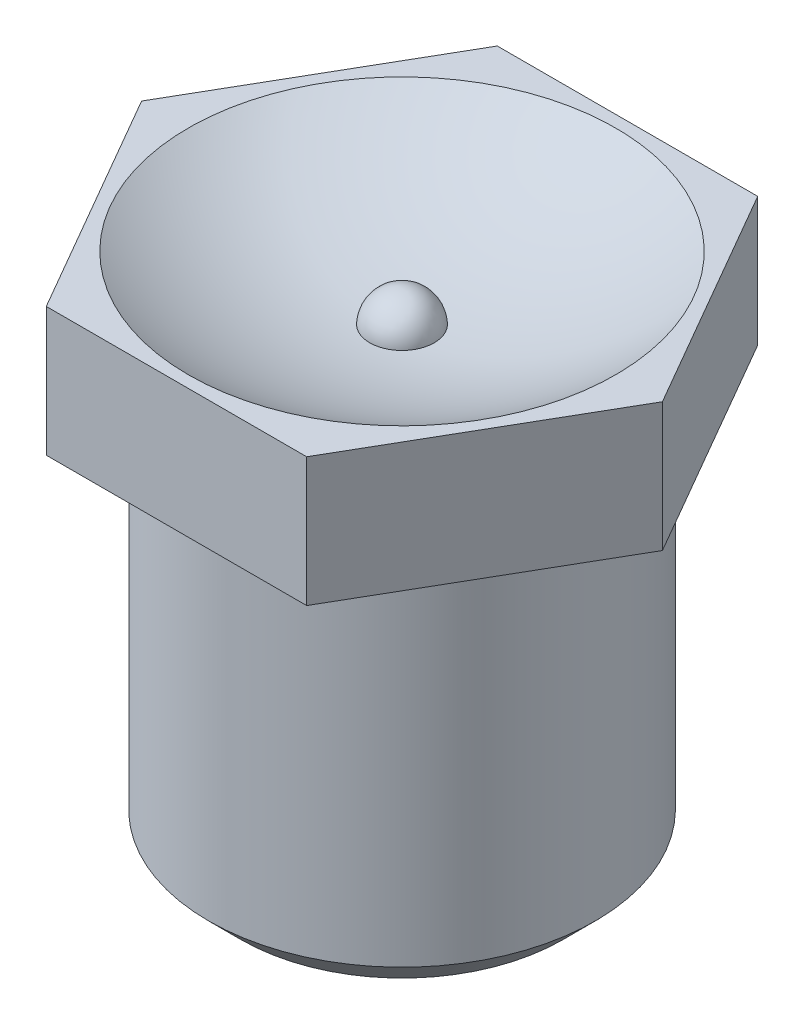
ISO-10303-21;
HEADER;
FILE_DESCRIPTION(('STEP AP214'),'2;1');
FILE_NAME('part.step','',(''),(''),'','','');
FILE_SCHEMA(('AUTOMOTIVE_DESIGN { 1 0 10303 214 1 1 1 1 }'));
ENDSEC;
DATA;
#1=APPLICATION_CONTEXT('core data for automotive mechanical design processes');
#2=APPLICATION_PROTOCOL_DEFINITION('international standard','automotive_design',2000,#1);
#3=PRODUCT_CONTEXT('',#1,'mechanical');
#4=PRODUCT('Part','Part','',(#3));
#5=PRODUCT_RELATED_PRODUCT_CATEGORY('part','',(#4));
#6=PRODUCT_DEFINITION_FORMATION('','',#4);
#7=PRODUCT_DEFINITION_CONTEXT('part definition',#1,'design');
#8=PRODUCT_DEFINITION('design','',#6,#7);
#9=PRODUCT_DEFINITION_SHAPE('','',#8);
#10=(LENGTH_UNIT() NAMED_UNIT(*) SI_UNIT(.MILLI.,.METRE.));
#11=(NAMED_UNIT(*) PLANE_ANGLE_UNIT() SI_UNIT($,.RADIAN.));
#12=(NAMED_UNIT(*) SI_UNIT($,.STERADIAN.) SOLID_ANGLE_UNIT());
#13=UNCERTAINTY_MEASURE_WITH_UNIT(LENGTH_MEASURE(1.E-05),#10,'distance_accuracy_value','');
#14=(GEOMETRIC_REPRESENTATION_CONTEXT(3) GLOBAL_UNCERTAINTY_ASSIGNED_CONTEXT((#13)) GLOBAL_UNIT_ASSIGNED_CONTEXT((#10,
#11,#12)) REPRESENTATION_CONTEXT('',''));
#15=CARTESIAN_POINT('',(0.,0.,0.));
#16=DIRECTION('',(0.,0.,1.));
#17=DIRECTION('',(1.,0.,0.));
#18=AXIS2_PLACEMENT_3D('',#15,#16,#17);
#19=CARTESIAN_POINT('',(0.,7.,-3.05311331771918E-13));
#20=DIRECTION('',(-1.,0.,0.));
#21=DIRECTION('',(0.,-1.,0.));
#22=AXIS2_PLACEMENT_3D('',#19,#20,#21);
#23=SPHERICAL_SURFACE('',#22,6.);
#24=CARTESIAN_POINT('',(0.,7.,-3.05311331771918E-13));
#25=DIRECTION('',(0.,1.,0.));
#26=DIRECTION('',(0.,0.,1.));
#27=AXIS2_PLACEMENT_3D('',#24,#25,#26);
#28=SPHERICAL_SURFACE('',#27,6.);
#29=CARTESIAN_POINT('',(0.,2.,-3.05311331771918E-13));
#30=DIRECTION('',(0.,1.,0.));
#31=DIRECTION('',(0.,0.,1.));
#32=AXIS2_PLACEMENT_3D('',#29,#30,#31);
#33=CIRCLE('',#32,3.3166247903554);
#34=CARTESIAN_POINT('',(0.,2.,3.31662479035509));
#35=VERTEX_POINT('',#34);
#36=EDGE_CURVE('E126',#35,#35,#33,.T.);
#37=ORIENTED_EDGE('',*,*,#36,.T.);
#38=EDGE_LOOP('',(#37));
#39=FACE_BOUND('',#38,.T.);
#40=CARTESIAN_POINT('',(0.,1.02083333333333,-3.05311331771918E-13));
#41=DIRECTION('',(0.,-1.,0.));
#42=DIRECTION('',(0.,0.,-1.));
#43=AXIS2_PLACEMENT_3D('',#40,#41,#42);
#44=CIRCLE('',#43,0.49956578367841);
#45=CARTESIAN_POINT('',(0.,1.02083333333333,-0.499565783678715));
#46=VERTEX_POINT('',#45);
#47=EDGE_CURVE('E11',#46,#46,#44,.F.);
#48=ORIENTED_EDGE('',*,*,#47,.F.);
#49=EDGE_LOOP('',(#48));
#50=FACE_BOUND('',#49,.T.);
#51=ADVANCED_FACE('F36',(#39,#50),#28,.F.);
#52=CARTESIAN_POINT('',(0.,-6.,0.));
#53=DIRECTION('',(0.,1.,0.));
#54=DIRECTION('',(0.,0.,1.));
#55=AXIS2_PLACEMENT_3D('',#52,#53,#54);
#56=CYLINDRICAL_SURFACE('',#55,3.);
#57=CARTESIAN_POINT('',(0.,-5.5,0.));
#58=DIRECTION('',(0.,1.,0.));
#59=DIRECTION('',(0.,0.,1.));
#60=AXIS2_PLACEMENT_3D('',#57,#58,#59);
#61=CIRCLE('',#60,3.);
#62=CARTESIAN_POINT('',(0.,-5.5,3.));
#63=VERTEX_POINT('',#62);
#64=EDGE_CURVE('E145',#63,#63,#61,.T.);
#65=ORIENTED_EDGE('',*,*,#64,.T.);
#66=EDGE_LOOP('',(#65));
#67=FACE_BOUND('',#66,.T.);
#68=CARTESIAN_POINT('',(0.,0.,0.));
#69=DIRECTION('',(0.,1.,0.));
#70=DIRECTION('',(0.,0.,1.));
#71=AXIS2_PLACEMENT_3D('',#68,#69,#70);
#72=CIRCLE('',#71,3.);
#73=CARTESIAN_POINT('',(0.,0.,3.));
#74=VERTEX_POINT('',#73);
#75=EDGE_CURVE('E142',#74,#74,#72,.T.);
#76=ORIENTED_EDGE('',*,*,#75,.F.);
#77=EDGE_LOOP('',(#76));
#78=FACE_BOUND('',#77,.T.);
#79=ADVANCED_FACE('F167',(#67,#78),#56,.T.);
#80=CARTESIAN_POINT('',(0.,-6.,0.));
#81=DIRECTION('',(0.,1.,0.));
#82=DIRECTION('',(0.,0.,1.));
#83=AXIS2_PLACEMENT_3D('',#80,#81,#82);
#84=PLANE('',#83);
#85=CARTESIAN_POINT('',(0.,-6.,0.));
#86=DIRECTION('',(0.,1.,0.));
#87=DIRECTION('',(0.,0.,1.));
#88=AXIS2_PLACEMENT_3D('',#85,#86,#87);
#89=CIRCLE('',#88,2.5);
#90=CARTESIAN_POINT('',(0.,-6.,2.5));
#91=VERTEX_POINT('',#90);
#92=EDGE_CURVE('E45',#91,#91,#89,.F.);
#93=ORIENTED_EDGE('',*,*,#92,.T.);
#94=EDGE_LOOP('',(#93));
#95=FACE_BOUND('',#94,.T.);
#96=ADVANCED_FACE('F171',(#95),#84,.F.);
#97=CARTESIAN_POINT('',(-2.02072594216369,1.99999999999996,3.4999999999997));
#98=DIRECTION('',(0.,0.,-1.));
#99=DIRECTION('',(-1.,0.,0.));
#100=AXIS2_PLACEMENT_3D('',#97,#98,#99);
#101=PLANE('',#100);
#102=DIRECTION('',(1.,0.,0.));
#103=VECTOR('',#102,1.);
#104=CARTESIAN_POINT('',(-2.02072594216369,0.,3.5));
#105=LINE('',#104,#103);
#106=CARTESIAN_POINT('',(-2.02072594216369,0.,3.5));
#107=VERTEX_POINT('',#106);
#108=CARTESIAN_POINT('',(2.02072594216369,0.,3.5));
#109=VERTEX_POINT('',#108);
#110=EDGE_CURVE('E122',#107,#109,#105,.T.);
#111=ORIENTED_EDGE('',*,*,#110,.T.);
#112=DIRECTION('',(0.,-1.,0.));
#113=VECTOR('',#112,1.);
#114=CARTESIAN_POINT('',(2.02072594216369,2.,3.4999999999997));
#115=LINE('',#114,#113);
#116=CARTESIAN_POINT('',(2.02072594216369,2.,3.4999999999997));
#117=VERTEX_POINT('',#116);
#118=EDGE_CURVE('E140',#117,#109,#115,.T.);
#119=ORIENTED_EDGE('',*,*,#118,.F.);
#120=DIRECTION('',(1.,0.,0.));
#121=VECTOR('',#120,1.);
#122=CARTESIAN_POINT('',(-2.02072594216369,1.99999999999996,3.4999999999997));
#123=LINE('',#122,#121);
#124=CARTESIAN_POINT('',(-2.02072594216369,1.99999999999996,3.4999999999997));
#125=VERTEX_POINT('',#124);
#126=EDGE_CURVE('E133',#125,#117,#123,.T.);
#127=ORIENTED_EDGE('',*,*,#126,.F.);
#128=DIRECTION('',(0.,-1.,0.));
#129=VECTOR('',#128,1.);
#130=CARTESIAN_POINT('',(-2.02072594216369,1.99999999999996,3.4999999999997));
#131=LINE('',#130,#129);
#132=EDGE_CURVE('E118',#125,#107,#131,.T.);
#133=ORIENTED_EDGE('',*,*,#132,.T.);
#134=EDGE_LOOP('',(#111,#119,#127,#133));
#135=FACE_BOUND('',#134,.T.);
#136=ADVANCED_FACE('F194',(#135),#101,.F.);
#137=CARTESIAN_POINT('',(2.02072594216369,2.,3.4999999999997));
#138=DIRECTION('',(-0.866025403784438,0.,-0.5));
#139=DIRECTION('',(-0.5,0.,0.866025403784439));
#140=AXIS2_PLACEMENT_3D('',#137,#138,#139);
#141=PLANE('',#140);
#142=DIRECTION('',(0.5,0.,-0.866025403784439));
#143=VECTOR('',#142,1.);
#144=CARTESIAN_POINT('',(2.02072594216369,0.,3.5));
#145=LINE('',#144,#143);
#146=CARTESIAN_POINT('',(4.04145188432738,0.,0.));
#147=VERTEX_POINT('',#146);
#148=EDGE_CURVE('E125',#109,#147,#145,.T.);
#149=ORIENTED_EDGE('',*,*,#148,.T.);
#150=DIRECTION('',(0.,-1.,0.));
#151=VECTOR('',#150,1.);
#152=CARTESIAN_POINT('',(4.04145188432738,2.,-3.05311331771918E-13));
#153=LINE('',#152,#151);
#154=CARTESIAN_POINT('',(4.04145188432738,2.,-3.05311331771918E-13));
#155=VERTEX_POINT('',#154);
#156=EDGE_CURVE('E137',#155,#147,#153,.T.);
#157=ORIENTED_EDGE('',*,*,#156,.F.);
#158=DIRECTION('',(0.5,0.,-0.866025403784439));
#159=VECTOR('',#158,1.);
#160=CARTESIAN_POINT('',(2.02072594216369,2.,3.4999999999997));
#161=LINE('',#160,#159);
#162=EDGE_CURVE('E91',#117,#155,#161,.T.);
#163=ORIENTED_EDGE('',*,*,#162,.F.);
#164=ORIENTED_EDGE('',*,*,#118,.T.);
#165=EDGE_LOOP('',(#149,#157,#163,#164));
#166=FACE_BOUND('',#165,.T.);
#167=ADVANCED_FACE('F198',(#166),#141,.F.);
#168=CARTESIAN_POINT('',(4.04145188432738,2.,-3.05311331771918E-13));
#169=DIRECTION('',(-0.866025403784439,0.,0.5));
#170=DIRECTION('',(0.5,0.,0.866025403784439));
#171=AXIS2_PLACEMENT_3D('',#168,#169,#170);
#172=PLANE('',#171);
#173=DIRECTION('',(-0.5,0.,-0.866025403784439));
#174=VECTOR('',#173,1.);
#175=CARTESIAN_POINT('',(4.04145188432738,0.,0.));
#176=LINE('',#175,#174);
#177=CARTESIAN_POINT('',(2.02072594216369,0.,-3.5));
#178=VERTEX_POINT('',#177);
#179=EDGE_CURVE('E128',#147,#178,#176,.T.);
#180=ORIENTED_EDGE('',*,*,#179,.T.);
#181=DIRECTION('',(0.,-1.,0.));
#182=VECTOR('',#181,1.);
#183=CARTESIAN_POINT('',(2.02072594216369,2.,-3.50000000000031));
#184=LINE('',#183,#182);
#185=CARTESIAN_POINT('',(2.02072594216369,2.,-3.50000000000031));
#186=VERTEX_POINT('',#185);
#187=EDGE_CURVE('E113',#186,#178,#184,.T.);
#188=ORIENTED_EDGE('',*,*,#187,.F.);
#189=DIRECTION('',(-0.5,0.,-0.866025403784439));
#190=VECTOR('',#189,1.);
#191=CARTESIAN_POINT('',(4.04145188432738,2.,-3.05311331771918E-13));
#192=LINE('',#191,#190);
#193=EDGE_CURVE('E104',#155,#186,#192,.T.);
#194=ORIENTED_EDGE('',*,*,#193,.F.);
#195=ORIENTED_EDGE('',*,*,#156,.T.);
#196=EDGE_LOOP('',(#180,#188,#194,#195));
#197=FACE_BOUND('',#196,.T.);
#198=ADVANCED_FACE('F200',(#197),#172,.F.);
#199=CARTESIAN_POINT('',(2.02072594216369,2.,-3.50000000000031));
#200=DIRECTION('',(0.,0.,1.));
#201=DIRECTION('',(1.,0.,0.));
#202=AXIS2_PLACEMENT_3D('',#199,#200,#201);
#203=PLANE('',#202);
#204=DIRECTION('',(-1.,0.,0.));
#205=VECTOR('',#204,1.);
#206=CARTESIAN_POINT('',(2.02072594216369,0.,-3.5));
#207=LINE('',#206,#205);
#208=CARTESIAN_POINT('',(-2.02072594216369,0.,-3.5));
#209=VERTEX_POINT('',#208);
#210=EDGE_CURVE('E112',#178,#209,#207,.T.);
#211=ORIENTED_EDGE('',*,*,#210,.T.);
#212=DIRECTION('',(0.,-1.,0.));
#213=VECTOR('',#212,1.);
#214=CARTESIAN_POINT('',(-2.02072594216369,1.99999999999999,-3.50000000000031));
#215=LINE('',#214,#213);
#216=CARTESIAN_POINT('',(-2.02072594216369,1.99999999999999,-3.50000000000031));
#217=VERTEX_POINT('',#216);
#218=EDGE_CURVE('E109',#217,#209,#215,.T.);
#219=ORIENTED_EDGE('',*,*,#218,.F.);
#220=DIRECTION('',(-1.,0.,0.));
#221=VECTOR('',#220,1.);
#222=CARTESIAN_POINT('',(2.02072594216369,2.,-3.50000000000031));
#223=LINE('',#222,#221);
#224=EDGE_CURVE('E98',#186,#217,#223,.T.);
#225=ORIENTED_EDGE('',*,*,#224,.F.);
#226=ORIENTED_EDGE('',*,*,#187,.T.);
#227=EDGE_LOOP('',(#211,#219,#225,#226));
#228=FACE_BOUND('',#227,.T.);
#229=ADVANCED_FACE('F110',(#228),#203,.F.);
#230=CARTESIAN_POINT('',(-2.02072594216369,1.99999999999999,-3.50000000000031));
#231=DIRECTION('',(0.866025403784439,0.,0.5));
#232=DIRECTION('',(0.5,0.,-0.866025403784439));
#233=AXIS2_PLACEMENT_3D('',#230,#231,#232);
#234=PLANE('',#233);
#235=DIRECTION('',(-0.5,0.,0.866025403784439));
#236=VECTOR('',#235,1.);
#237=CARTESIAN_POINT('',(-2.02072594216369,0.,-3.5));
#238=LINE('',#237,#236);
#239=CARTESIAN_POINT('',(-4.04145188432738,0.,0.));
#240=VERTEX_POINT('',#239);
#241=EDGE_CURVE('E76',#209,#240,#238,.T.);
#242=ORIENTED_EDGE('',*,*,#241,.T.);
#243=DIRECTION('',(0.,-1.,0.));
#244=VECTOR('',#243,1.);
#245=CARTESIAN_POINT('',(-4.04145188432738,2.,-3.05311331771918E-13));
#246=LINE('',#245,#244);
#247=CARTESIAN_POINT('',(-4.04145188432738,2.,-3.05311331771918E-13));
#248=VERTEX_POINT('',#247);
#249=EDGE_CURVE('E114',#248,#240,#246,.T.);
#250=ORIENTED_EDGE('',*,*,#249,.F.);
#251=DIRECTION('',(-0.5,0.,0.866025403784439));
#252=VECTOR('',#251,1.);
#253=CARTESIAN_POINT('',(-2.02072594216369,1.99999999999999,-3.50000000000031));
#254=LINE('',#253,#252);
#255=EDGE_CURVE('E102',#217,#248,#254,.T.);
#256=ORIENTED_EDGE('',*,*,#255,.F.);
#257=ORIENTED_EDGE('',*,*,#218,.T.);
#258=EDGE_LOOP('',(#242,#250,#256,#257));
#259=FACE_BOUND('',#258,.T.);
#260=ADVANCED_FACE('F116',(#259),#234,.F.);
#261=CARTESIAN_POINT('',(-4.04145188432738,2.,-3.05311331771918E-13));
#262=DIRECTION('',(0.866025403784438,0.,-0.5));
#263=DIRECTION('',(-0.5,0.,-0.866025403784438));
#264=AXIS2_PLACEMENT_3D('',#261,#262,#263);
#265=PLANE('',#264);
#266=DIRECTION('',(0.5,0.,0.866025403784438));
#267=VECTOR('',#266,1.);
#268=CARTESIAN_POINT('',(-4.04145188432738,0.,0.));
#269=LINE('',#268,#267);
#270=EDGE_CURVE('E82',#240,#107,#269,.T.);
#271=ORIENTED_EDGE('',*,*,#270,.T.);
#272=ORIENTED_EDGE('',*,*,#132,.F.);
#273=DIRECTION('',(0.5,0.,0.866025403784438));
#274=VECTOR('',#273,1.);
#275=CARTESIAN_POINT('',(-4.04145188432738,2.,-3.05311331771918E-13));
#276=LINE('',#275,#274);
#277=EDGE_CURVE('E53',#248,#125,#276,.T.);
#278=ORIENTED_EDGE('',*,*,#277,.F.);
#279=ORIENTED_EDGE('',*,*,#249,.T.);
#280=EDGE_LOOP('',(#271,#272,#278,#279));
#281=FACE_BOUND('',#280,.T.);
#282=ADVANCED_FACE('F156',(#281),#265,.F.);
#283=CARTESIAN_POINT('',(6.06217782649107,1.99999999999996,3.4999999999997));
#284=DIRECTION('',(0.,1.,0.));
#285=DIRECTION('',(0.,0.,1.));
#286=AXIS2_PLACEMENT_3D('',#283,#284,#285);
#287=PLANE('',#286);
#288=ORIENTED_EDGE('',*,*,#36,.F.);
#289=EDGE_LOOP('',(#288));
#290=FACE_BOUND('',#289,.T.);
#291=ORIENTED_EDGE('',*,*,#126,.T.);
#292=ORIENTED_EDGE('',*,*,#162,.T.);
#293=ORIENTED_EDGE('',*,*,#193,.T.);
#294=ORIENTED_EDGE('',*,*,#224,.T.);
#295=ORIENTED_EDGE('',*,*,#255,.T.);
#296=ORIENTED_EDGE('',*,*,#277,.T.);
#297=EDGE_LOOP('',(#291,#292,#293,#294,#295,#296));
#298=FACE_BOUND('',#297,.T.);
#299=ADVANCED_FACE('F100',(#290,#298),#287,.T.);
#300=CARTESIAN_POINT('',(6.06217782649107,0.,3.5));
#301=DIRECTION('',(0.,1.,0.));
#302=DIRECTION('',(0.,0.,1.));
#303=AXIS2_PLACEMENT_3D('',#300,#301,#302);
#304=PLANE('',#303);
#305=ORIENTED_EDGE('',*,*,#75,.T.);
#306=EDGE_LOOP('',(#305));
#307=FACE_BOUND('',#306,.T.);
#308=ORIENTED_EDGE('',*,*,#110,.F.);
#309=ORIENTED_EDGE('',*,*,#270,.F.);
#310=ORIENTED_EDGE('',*,*,#241,.F.);
#311=ORIENTED_EDGE('',*,*,#210,.F.);
#312=ORIENTED_EDGE('',*,*,#179,.F.);
#313=ORIENTED_EDGE('',*,*,#148,.F.);
#314=EDGE_LOOP('',(#308,#309,#310,#311,#312,#313));
#315=FACE_BOUND('',#314,.T.);
#316=ADVANCED_FACE('F155',(#307,#315),#304,.F.);
#317=CARTESIAN_POINT('',(0.,-5.5,0.));
#318=DIRECTION('',(0.,1.,0.));
#319=DIRECTION('',(0.,0.,1.));
#320=AXIS2_PLACEMENT_3D('',#317,#318,#319);
#321=CONICAL_SURFACE('',#320,3.,0.78539816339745);
#322=ORIENTED_EDGE('',*,*,#92,.F.);
#323=EDGE_LOOP('',(#322));
#324=FACE_BOUND('',#323,.T.);
#325=ORIENTED_EDGE('',*,*,#64,.F.);
#326=EDGE_LOOP('',(#325));
#327=FACE_BOUND('',#326,.T.);
#328=ADVANCED_FACE('F38',(#324,#327),#321,.T.);
#329=CARTESIAN_POINT('',(0.,1.,-3.05311331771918E-13));
#330=DIRECTION('',(-1.,0.,0.));
#331=DIRECTION('',(0.,1.,0.));
#332=AXIS2_PLACEMENT_3D('',#329,#330,#331);
#333=SPHERICAL_SURFACE('',#332,0.5);
#334=CARTESIAN_POINT('',(0.,1.,-3.05311331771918E-13));
#335=DIRECTION('',(0.,-1.,0.));
#336=DIRECTION('',(0.,0.,-1.));
#337=AXIS2_PLACEMENT_3D('',#334,#335,#336);
#338=SPHERICAL_SURFACE('',#337,0.5);
#339=ORIENTED_EDGE('',*,*,#47,.T.);
#340=EDGE_LOOP('',(#339));
#341=FACE_BOUND('',#340,.T.);
#342=ADVANCED_FACE('F174',(#341),#338,.T.);
#343=CLOSED_SHELL('',(#51,#79,#96,#136,#167,#198,#229,#260,#282,#299,#316,#328,#342));
#344=MANIFOLD_SOLID_BREP('B2',#343);
#345=ADVANCED_BREP_SHAPE_REPRESENTATION('',(#18,#344),#14);
#346=SHAPE_DEFINITION_REPRESENTATION(#9,#345);
ENDSEC;
END-ISO-10303-21;
